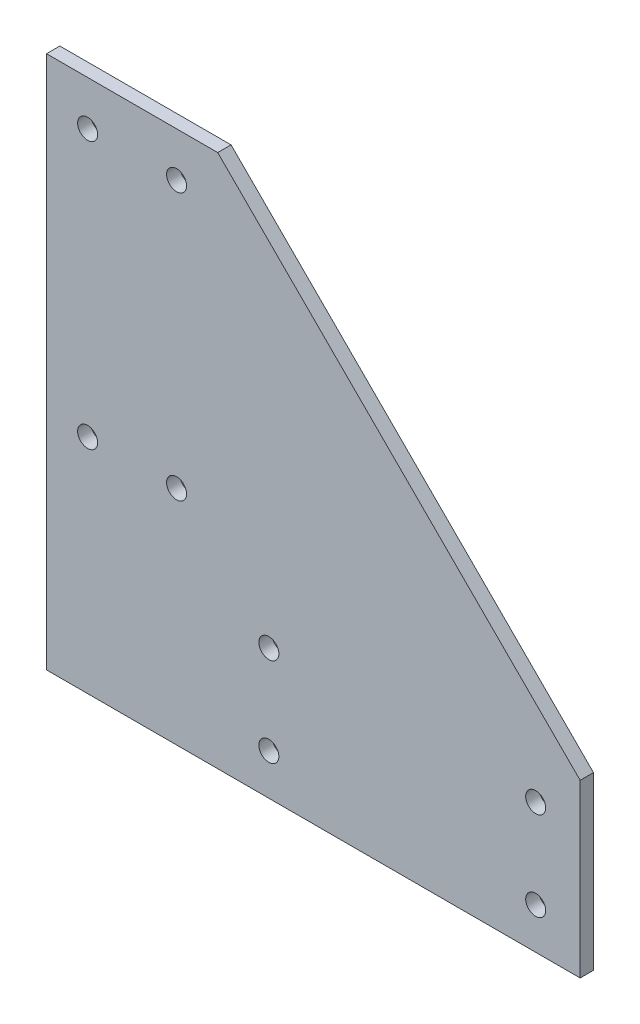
from build123d import *

# Parameters (mm, degrees)
LINEAR_AUSTRAGEN1_DEPTH                 = 6
F_9_0_9_DURCHMESSER_BOHRUNG2_AT_2_COUNT = 2
F_9_0_9_DURCHMESSER_BOHRUNG2_AT_2_PITCH = 40
F_9_0_9_DURCHMESSER_BOHRUNG2_AT_3_COUNT = 2
F_9_0_9_DURCHMESSER_BOHRUNG2_AT_3_PITCH = 120
F_9_0_9_DURCHMESSER_BOHRUNG2_AT_4_COUNT = 2
F_9_0_9_DURCHMESSER_BOHRUNG2_AT_4_PITCH = 126.491106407


with BuildPart() as part:
    # Skizze3 → Linear austragen1 (new body)
    with BuildSketch(Plane.XY):
        Polygon((-120, 120), (-43, 120), (120, -43), (120, -120), (-120, -120), align=None)
    extrude(amount=LINEAR_AUSTRAGEN1_DEPTH)

    # Skizze6 → 9.0 _9_ Durchmesser Bohrung2 (revolve, cut)
    with BuildSketch(Plane(origin=(-101.5, -20, 6), x_dir=(0, -1, 0), z_dir=(1, 0, 0))):
        Polygon((0, 0), (0, 12.703872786), (4.5, 10), (4.5, 0), align=None)
    f_9_0_9_durchmesser_bohrung2 = revolve(axis=Axis((-101.5, -20, 12.35), (0, 0, -1)), mode=Mode.SUBTRACT)

    # 9.0 _9_ Durchmesser Bohrung2 at 2: 9.0 _9_ Durchmesser Bohrung2 ×2
    with Locations(*[(i * F_9_0_9_DURCHMESSER_BOHRUNG2_AT_2_PITCH, 0, 0) for i in range(1, F_9_0_9_DURCHMESSER_BOHRUNG2_AT_2_COUNT)]):
        add(f_9_0_9_durchmesser_bohrung2, mode=Mode.SUBTRACT)

    # 9.0 _9_ Durchmesser Bohrung2 at 3: 9.0 _9_ Durchmesser Bohrung2 ×2
    with Locations(*[(0, i * F_9_0_9_DURCHMESSER_BOHRUNG2_AT_3_PITCH, 0) for i in range(1, F_9_0_9_DURCHMESSER_BOHRUNG2_AT_3_COUNT)]):
        add(f_9_0_9_durchmesser_bohrung2, mode=Mode.SUBTRACT)

    # 9.0 _9_ Durchmesser Bohrung2 at 4: 9.0 _9_ Durchmesser Bohrung2 ×2
    with Locations(*[Vector(0.31622776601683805, 0.9486832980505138, 0) * (i * F_9_0_9_DURCHMESSER_BOHRUNG2_AT_4_PITCH) for i in range(1, F_9_0_9_DURCHMESSER_BOHRUNG2_AT_4_COUNT)]):
        add(f_9_0_9_durchmesser_bohrung2, mode=Mode.SUBTRACT)

    # Spiegeln1: 9.0 _9_ Durchmesser Bohrung2 across plane
    add(f_9_0_9_durchmesser_bohrung2.mirror(Plane(origin=(0, 0, 0), x_dir=(0, 0, 1), z_dir=(0.7071067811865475, -0.7071067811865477, 0))), mode=Mode.SUBTRACT)

    # Spiegeln1 copy 1 sketch → Spiegeln1 copy 1 (revolve, cut)
    with BuildSketch(Plane(origin=(-20, -61.5, 6), x_dir=(-1, 0, 0), z_dir=(0, 1, 0))):
        Polygon((0, 0), (0, -12.703872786), (4.5, -10), (4.5, 0), align=None)
    revolve(axis=Axis((-20, -61.5, 12.35), (0, 0, 1)), mode=Mode.SUBTRACT)

    # Spiegeln1 copy 2 sketch → Spiegeln1 copy 2 (revolve, cut)
    with BuildSketch(Plane(origin=(100, -101.5, 6), x_dir=(-1, 0, 0), z_dir=(0, 1, 0))):
        Polygon((0, 0), (0, -12.703872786), (4.5, -10), (4.5, 0), align=None)
    revolve(axis=Axis((100, -101.5, 12.35), (0, 0, 1)), mode=Mode.SUBTRACT)

    # Spiegeln1 copy 3 sketch → Spiegeln1 copy 3 (revolve, cut)
    with BuildSketch(Plane(origin=(100, -61.5, 6), x_dir=(-1, 0, 0), z_dir=(0, 1, 0))):
        Polygon((0, 0), (0, -12.703872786), (4.5, -10), (4.5, 0), align=None)
    revolve(axis=Axis((100, -61.5, 12.35), (0, 0, 1)), mode=Mode.SUBTRACT)


solid = part.part
